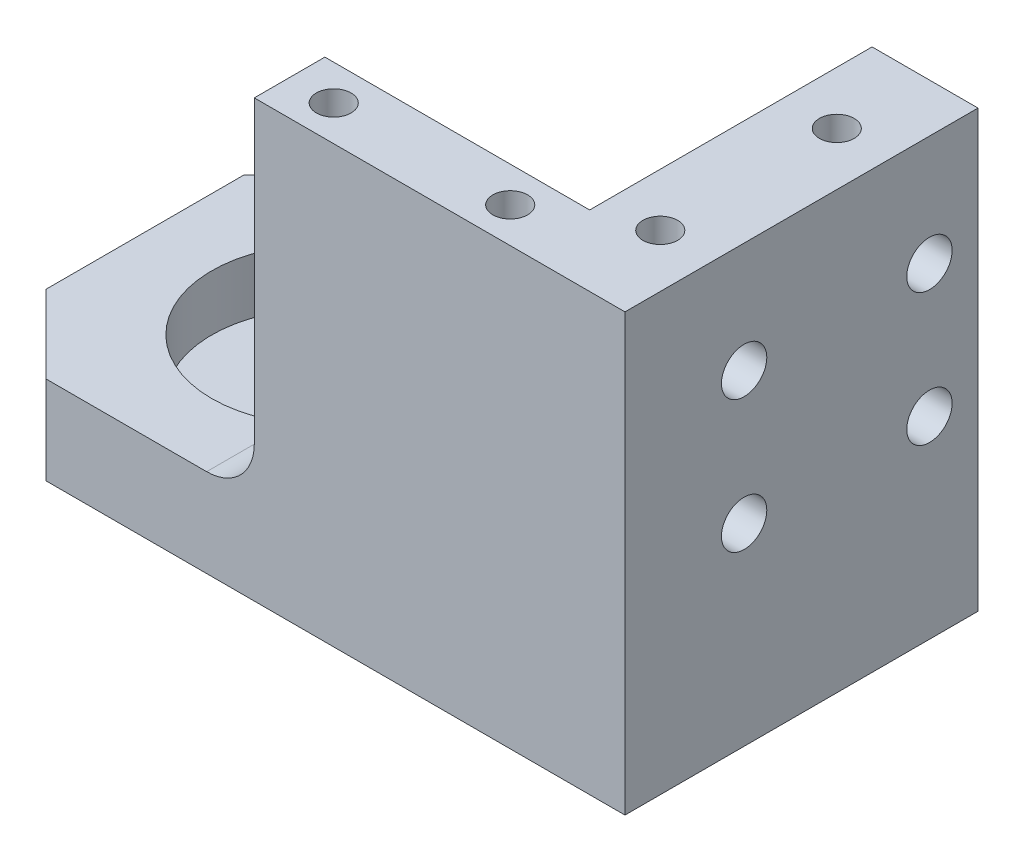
ISO-10303-21;
HEADER;
FILE_DESCRIPTION(('STEP AP214'),'2;1');
FILE_NAME('part.step','',(''),(''),'','','');
FILE_SCHEMA(('AUTOMOTIVE_DESIGN { 1 0 10303 214 1 1 1 1 }'));
ENDSEC;
DATA;
#1=APPLICATION_CONTEXT('core data for automotive mechanical design processes');
#2=APPLICATION_PROTOCOL_DEFINITION('international standard','automotive_design',2000,#1);
#3=PRODUCT_CONTEXT('',#1,'mechanical');
#4=PRODUCT('Part','Part','',(#3));
#5=PRODUCT_RELATED_PRODUCT_CATEGORY('part','',(#4));
#6=PRODUCT_DEFINITION_FORMATION('','',#4);
#7=PRODUCT_DEFINITION_CONTEXT('part definition',#1,'design');
#8=PRODUCT_DEFINITION('design','',#6,#7);
#9=PRODUCT_DEFINITION_SHAPE('','',#8);
#10=(LENGTH_UNIT() NAMED_UNIT(*) SI_UNIT(.MILLI.,.METRE.));
#11=(NAMED_UNIT(*) PLANE_ANGLE_UNIT() SI_UNIT($,.RADIAN.));
#12=(NAMED_UNIT(*) SI_UNIT($,.STERADIAN.) SOLID_ANGLE_UNIT());
#13=UNCERTAINTY_MEASURE_WITH_UNIT(LENGTH_MEASURE(1.E-05),#10,'distance_accuracy_value','');
#14=(GEOMETRIC_REPRESENTATION_CONTEXT(3) GLOBAL_UNCERTAINTY_ASSIGNED_CONTEXT((#13)) GLOBAL_UNIT_ASSIGNED_CONTEXT((#10,
#11,#12)) REPRESENTATION_CONTEXT('',''));
#15=CARTESIAN_POINT('',(0.,0.,0.));
#16=DIRECTION('',(0.,0.,1.));
#17=DIRECTION('',(1.,0.,0.));
#18=AXIS2_PLACEMENT_3D('',#15,#16,#17);
#19=CARTESIAN_POINT('',(-1.27,-36.0425,8.9916));
#20=DIRECTION('',(0.,1.,0.));
#21=DIRECTION('',(0.,0.,1.));
#22=AXIS2_PLACEMENT_3D('',#19,#20,#21);
#23=PLANE('',#22);
#24=DIRECTION('',(-1.,0.,0.));
#25=VECTOR('',#24,1.);
#26=CARTESIAN_POINT('',(-7.61999999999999,-36.0425,-10.16));
#27=LINE('',#26,#25);
#28=CARTESIAN_POINT('',(-7.61999999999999,-36.0425,-10.16));
#29=VERTEX_POINT('',#28);
#30=CARTESIAN_POINT('',(-18.796,-36.0425,-10.16));
#31=VERTEX_POINT('',#30);
#32=EDGE_CURVE('E273',#29,#31,#27,.T.);
#33=ORIENTED_EDGE('',*,*,#32,.F.);
#34=DIRECTION('',(0.,0.,1.));
#35=VECTOR('',#34,1.);
#36=CARTESIAN_POINT('',(-7.61999999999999,-36.0425,-12.7));
#37=LINE('',#36,#35);
#38=CARTESIAN_POINT('',(-7.61999999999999,-36.0425,-12.7));
#39=VERTEX_POINT('',#38);
#40=EDGE_CURVE('E270',#39,#29,#37,.T.);
#41=ORIENTED_EDGE('',*,*,#40,.F.);
#42=DIRECTION('',(1.,0.,0.));
#43=VECTOR('',#42,1.);
#44=CARTESIAN_POINT('',(-1.27,-36.0425,-12.7));
#45=LINE('',#44,#43);
#46=CARTESIAN_POINT('',(0.,-36.0425,-12.7));
#47=VERTEX_POINT('',#46);
#48=EDGE_CURVE('E316',#39,#47,#45,.T.);
#49=ORIENTED_EDGE('',*,*,#48,.T.);
#50=DIRECTION('',(0.,0.,1.));
#51=VECTOR('',#50,1.);
#52=CARTESIAN_POINT('',(0.,-36.0425,8.9916));
#53=LINE('',#52,#51);
#54=CARTESIAN_POINT('',(0.,-36.0425,12.7));
#55=VERTEX_POINT('',#54);
#56=EDGE_CURVE('E321',#47,#55,#53,.T.);
#57=ORIENTED_EDGE('',*,*,#56,.T.);
#58=DIRECTION('',(-1.,0.,0.));
#59=VECTOR('',#58,1.);
#60=CARTESIAN_POINT('',(-1.27,-36.0425,12.7));
#61=LINE('',#60,#59);
#62=CARTESIAN_POINT('',(-41.656,-36.0425,12.7));
#63=VERTEX_POINT('',#62);
#64=EDGE_CURVE('E307',#55,#63,#61,.T.);
#65=ORIENTED_EDGE('',*,*,#64,.T.);
#66=DIRECTION('',(0.707106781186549,0.,0.707106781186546));
#67=VECTOR('',#66,1.);
#68=CARTESIAN_POINT('',(-47.244,-36.0425,7.11199999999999));
#69=LINE('',#68,#67);
#70=CARTESIAN_POINT('',(-47.244,-36.0425,7.11199999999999));
#71=VERTEX_POINT('',#70);
#72=EDGE_CURVE('E477',#63,#71,#69,.F.);
#73=ORIENTED_EDGE('',*,*,#72,.T.);
#74=DIRECTION('',(0.,0.,-1.));
#75=VECTOR('',#74,1.);
#76=CARTESIAN_POINT('',(-47.244,-36.0425,12.7));
#77=LINE('',#76,#75);
#78=CARTESIAN_POINT('',(-47.244,-36.0425,-7.11199999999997));
#79=VERTEX_POINT('',#78);
#80=EDGE_CURVE('E311',#71,#79,#77,.T.);
#81=ORIENTED_EDGE('',*,*,#80,.T.);
#82=DIRECTION('',(-0.707106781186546,0.,0.707106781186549));
#83=VECTOR('',#82,1.);
#84=CARTESIAN_POINT('',(-41.656,-36.0425,-12.7));
#85=LINE('',#84,#83);
#86=CARTESIAN_POINT('',(-41.656,-36.0425,-12.7));
#87=VERTEX_POINT('',#86);
#88=EDGE_CURVE('E472',#79,#87,#85,.F.);
#89=ORIENTED_EDGE('',*,*,#88,.T.);
#90=CARTESIAN_POINT('',(-18.796,-36.0425,-12.7));
#91=VERTEX_POINT('',#90);
#92=EDGE_CURVE('E317',#87,#91,#45,.T.);
#93=ORIENTED_EDGE('',*,*,#92,.T.);
#94=DIRECTION('',(0.,0.,-1.));
#95=VECTOR('',#94,1.);
#96=CARTESIAN_POINT('',(-18.796,-36.0425,-12.7));
#97=LINE('',#96,#95);
#98=EDGE_CURVE('E277',#31,#91,#97,.T.);
#99=ORIENTED_EDGE('',*,*,#98,.F.);
#100=EDGE_LOOP('',(#33,#41,#49,#57,#65,#73,#81,#89,#93,#99));
#101=FACE_BOUND('',#100,.T.);
#102=CARTESIAN_POINT('',(-34.47288,-36.0425,0.));
#103=DIRECTION('',(0.,1.,0.));
#104=DIRECTION('',(0.,0.,1.));
#105=AXIS2_PLACEMENT_3D('',#102,#103,#104);
#106=CIRCLE('',#105,7.9375);
#107=CARTESIAN_POINT('',(-34.47288,-36.0425,7.9375));
#108=VERTEX_POINT('',#107);
#109=EDGE_CURVE('E12',#108,#108,#106,.F.);
#110=ORIENTED_EDGE('',*,*,#109,.F.);
#111=EDGE_LOOP('',(#110));
#112=FACE_BOUND('',#111,.T.);
#113=ADVANCED_FACE('F47',(#101,#112),#23,.F.);
#114=CARTESIAN_POINT('',(-34.47288,0.001000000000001,0.));
#115=DIRECTION('',(0.,-1.,0.));
#116=DIRECTION('',(0.,0.,-1.));
#117=AXIS2_PLACEMENT_3D('',#114,#115,#116);
#118=CYLINDRICAL_SURFACE('',#117,3.33375);
#119=CARTESIAN_POINT('',(-34.47288,-36.0425,0.));
#120=DIRECTION('',(0.,-1.,0.));
#121=DIRECTION('',(0.,0.,-1.));
#122=AXIS2_PLACEMENT_3D('',#119,#120,#121);
#123=CIRCLE('',#122,3.33375);
#124=CARTESIAN_POINT('',(-34.47288,-36.0425,-3.33375));
#125=VERTEX_POINT('',#124);
#126=EDGE_CURVE('E302',#125,#125,#123,.T.);
#127=ORIENTED_EDGE('',*,*,#126,.T.);
#128=EDGE_LOOP('',(#127));
#129=FACE_BOUND('',#128,.T.);
#130=CARTESIAN_POINT('',(-34.47288,-33.6925,0.));
#131=DIRECTION('',(0.,1.,0.));
#132=DIRECTION('',(0.,0.,1.));
#133=AXIS2_PLACEMENT_3D('',#130,#131,#132);
#134=CIRCLE('',#133,3.33375);
#135=CARTESIAN_POINT('',(-34.47288,-33.6925,3.33375));
#136=VERTEX_POINT('',#135);
#137=EDGE_CURVE('E228',#136,#136,#134,.F.);
#138=ORIENTED_EDGE('',*,*,#137,.F.);
#139=EDGE_LOOP('',(#138));
#140=FACE_BOUND('',#139,.T.);
#141=ADVANCED_FACE('F402',(#129,#140),#118,.F.);
#142=CARTESIAN_POINT('',(-47.244,0.,-12.7));
#143=DIRECTION('',(0.,0.,1.));
#144=DIRECTION('',(-1.,0.,0.));
#145=AXIS2_PLACEMENT_3D('',#142,#143,#144);
#146=PLANE('',#145);
#147=CARTESIAN_POINT('',(-4.14019999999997,-32.8675,-12.7));
#148=DIRECTION('',(0.,0.,-1.));
#149=DIRECTION('',(-1.,0.,0.));
#150=AXIS2_PLACEMENT_3D('',#147,#148,#149);
#151=CIRCLE('',#150,1.28905);
#152=CARTESIAN_POINT('',(-5.42924999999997,-32.8675,-12.7));
#153=VERTEX_POINT('',#152);
#154=EDGE_CURVE('E266',#153,#153,#151,.T.);
#155=ORIENTED_EDGE('',*,*,#154,.F.);
#156=EDGE_LOOP('',(#155));
#157=FACE_BOUND('',#156,.T.);
#158=DIRECTION('',(0.,-1.,0.));
#159=VECTOR('',#158,1.);
#160=CARTESIAN_POINT('',(-7.62,-5.07999999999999,-12.7));
#161=LINE('',#160,#159);
#162=CARTESIAN_POINT('',(-7.62,-4.686249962,-12.7));
#163=VERTEX_POINT('',#162);
#164=EDGE_CURVE('E343',#163,#39,#161,.T.);
#165=ORIENTED_EDGE('',*,*,#164,.F.);
#166=DIRECTION('',(-1.,0.,0.));
#167=VECTOR('',#166,1.);
#168=CARTESIAN_POINT('',(0.,-4.686249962,-12.7));
#169=LINE('',#168,#167);
#170=CARTESIAN_POINT('',(0.,-4.686249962,-12.7));
#171=VERTEX_POINT('',#170);
#172=EDGE_CURVE('E202',#171,#163,#169,.T.);
#173=ORIENTED_EDGE('',*,*,#172,.F.);
#174=DIRECTION('',(0.,-1.,0.));
#175=VECTOR('',#174,1.);
#176=CARTESIAN_POINT('',(0.,-36.0425,-12.7));
#177=LINE('',#176,#175);
#178=EDGE_CURVE('E299',#171,#47,#177,.T.);
#179=ORIENTED_EDGE('',*,*,#178,.T.);
#180=ORIENTED_EDGE('',*,*,#48,.F.);
#181=EDGE_LOOP('',(#165,#173,#179,#180));
#182=FACE_BOUND('',#181,.T.);
#183=ADVANCED_FACE('F404',(#157,#182),#146,.F.);
#184=CARTESIAN_POINT('',(-23.1902,-32.8675,-12.7));
#185=DIRECTION('',(0.,0.,-1.));
#186=DIRECTION('',(-1.,0.,0.));
#187=AXIS2_PLACEMENT_3D('',#184,#185,#186);
#188=CIRCLE('',#187,1.28905);
#189=CARTESIAN_POINT('',(-24.47925,-32.8675,-12.7));
#190=VERTEX_POINT('',#189);
#191=EDGE_CURVE('E258',#190,#190,#188,.T.);
#192=ORIENTED_EDGE('',*,*,#191,.F.);
#193=EDGE_LOOP('',(#192));
#194=FACE_BOUND('',#193,.T.);
#195=DIRECTION('',(1.,0.,0.));
#196=VECTOR('',#195,1.);
#197=CARTESIAN_POINT('',(-1.27,-29.6925,-12.7));
#198=LINE('',#197,#196);
#199=CARTESIAN_POINT('',(-41.656,-29.6925,-12.7));
#200=VERTEX_POINT('',#199);
#201=CARTESIAN_POINT('',(-18.796,-29.6925,-12.7));
#202=VERTEX_POINT('',#201);
#203=EDGE_CURVE('E312',#200,#202,#198,.T.);
#204=ORIENTED_EDGE('',*,*,#203,.T.);
#205=DIRECTION('',(0.,-1.,0.));
#206=VECTOR('',#205,1.);
#207=CARTESIAN_POINT('',(-18.796,-23.3425,-12.7));
#208=LINE('',#207,#206);
#209=EDGE_CURVE('E280',#202,#91,#208,.T.);
#210=ORIENTED_EDGE('',*,*,#209,.T.);
#211=ORIENTED_EDGE('',*,*,#92,.F.);
#212=DIRECTION('',(0.,1.,0.));
#213=VECTOR('',#212,1.);
#214=CARTESIAN_POINT('',(-41.656,0.,-12.7));
#215=LINE('',#214,#213);
#216=EDGE_CURVE('E347',#87,#200,#215,.T.);
#217=ORIENTED_EDGE('',*,*,#216,.T.);
#218=EDGE_LOOP('',(#204,#210,#211,#217));
#219=FACE_BOUND('',#218,.T.);
#220=ADVANCED_FACE('F411',(#194,#219),#146,.F.);
#221=CARTESIAN_POINT('',(-7.62,-5.07999999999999,12.7));
#222=DIRECTION('',(1.,0.,0.));
#223=DIRECTION('',(0.,1.,0.));
#224=AXIS2_PLACEMENT_3D('',#221,#222,#223);
#225=PLANE('',#224);
#226=CARTESIAN_POINT('',(-7.62,-12.62375,4.1275));
#227=DIRECTION('',(1.,0.,0.));
#228=DIRECTION('',(0.,1.,0.));
#229=AXIS2_PLACEMENT_3D('',#226,#227,#228);
#230=CIRCLE('',#229,1.63194999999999);
#231=CARTESIAN_POINT('',(-7.62,-10.9918,4.1275));
#232=VERTEX_POINT('',#231);
#233=EDGE_CURVE('E236',#232,#232,#230,.T.);
#234=ORIENTED_EDGE('',*,*,#233,.T.);
#235=EDGE_LOOP('',(#234));
#236=FACE_BOUND('',#235,.T.);
#237=CARTESIAN_POINT('',(-7.62,-12.62375,-9.2075));
#238=DIRECTION('',(1.,0.,0.));
#239=DIRECTION('',(0.,1.,0.));
#240=AXIS2_PLACEMENT_3D('',#237,#238,#239);
#241=CIRCLE('',#240,1.63194999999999);
#242=CARTESIAN_POINT('',(-7.62,-10.9918,-9.2075));
#243=VERTEX_POINT('',#242);
#244=EDGE_CURVE('E243',#243,#243,#241,.T.);
#245=ORIENTED_EDGE('',*,*,#244,.T.);
#246=EDGE_LOOP('',(#245));
#247=FACE_BOUND('',#246,.T.);
#248=CARTESIAN_POINT('',(-7.62,-22.14875,4.1275));
#249=DIRECTION('',(1.,0.,0.));
#250=DIRECTION('',(0.,1.,0.));
#251=AXIS2_PLACEMENT_3D('',#248,#249,#250);
#252=CIRCLE('',#251,1.63194999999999);
#253=CARTESIAN_POINT('',(-7.62,-20.5168,4.1275));
#254=VERTEX_POINT('',#253);
#255=EDGE_CURVE('E248',#254,#254,#252,.T.);
#256=ORIENTED_EDGE('',*,*,#255,.T.);
#257=EDGE_LOOP('',(#256));
#258=FACE_BOUND('',#257,.T.);
#259=CARTESIAN_POINT('',(-7.62,-22.14875,-9.2075));
#260=DIRECTION('',(1.,0.,0.));
#261=DIRECTION('',(0.,1.,0.));
#262=AXIS2_PLACEMENT_3D('',#259,#260,#261);
#263=CIRCLE('',#262,1.63194999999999);
#264=CARTESIAN_POINT('',(-7.62,-20.5168,-9.2075));
#265=VERTEX_POINT('',#264);
#266=EDGE_CURVE('E253',#265,#265,#263,.T.);
#267=ORIENTED_EDGE('',*,*,#266,.T.);
#268=EDGE_LOOP('',(#267));
#269=FACE_BOUND('',#268,.T.);
#270=DIRECTION('',(0.,-1.,0.));
#271=VECTOR('',#270,1.);
#272=CARTESIAN_POINT('',(-7.61999999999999,-23.3425,-10.16));
#273=LINE('',#272,#271);
#274=CARTESIAN_POINT('',(-7.62,-26.2635,-10.16));
#275=VERTEX_POINT('',#274);
#276=EDGE_CURVE('E66',#275,#29,#273,.T.);
#277=ORIENTED_EDGE('',*,*,#276,.F.);
#278=DIRECTION('',(0.,0.,-1.));
#279=VECTOR('',#278,1.);
#280=CARTESIAN_POINT('',(-7.62,-26.2635,12.7));
#281=LINE('',#280,#279);
#282=CARTESIAN_POINT('',(-7.62,-26.2635,7.62));
#283=VERTEX_POINT('',#282);
#284=EDGE_CURVE('E74',#275,#283,#281,.F.);
#285=ORIENTED_EDGE('',*,*,#284,.T.);
#286=DIRECTION('',(0.,1.,0.));
#287=VECTOR('',#286,1.);
#288=CARTESIAN_POINT('',(-7.62,-5.07999999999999,7.62));
#289=LINE('',#288,#287);
#290=CARTESIAN_POINT('',(-7.62,-4.686249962,7.62));
#291=VERTEX_POINT('',#290);
#292=EDGE_CURVE('E177',#283,#291,#289,.T.);
#293=ORIENTED_EDGE('',*,*,#292,.T.);
#294=DIRECTION('',(0.,0.,1.));
#295=VECTOR('',#294,1.);
#296=CARTESIAN_POINT('',(-7.62,-4.686249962,-12.7));
#297=LINE('',#296,#295);
#298=EDGE_CURVE('E181',#163,#291,#297,.T.);
#299=ORIENTED_EDGE('',*,*,#298,.F.);
#300=ORIENTED_EDGE('',*,*,#164,.T.);
#301=ORIENTED_EDGE('',*,*,#40,.T.);
#302=EDGE_LOOP('',(#277,#285,#293,#299,#300,#301));
#303=FACE_BOUND('',#302,.T.);
#304=ADVANCED_FACE('F179',(#236,#247,#258,#269,#303),#225,.F.);
#305=CARTESIAN_POINT('',(0.,0.,12.7));
#306=DIRECTION('',(-1.,0.,0.));
#307=DIRECTION('',(0.,-1.,0.));
#308=AXIS2_PLACEMENT_3D('',#305,#306,#307);
#309=PLANE('',#308);
#310=CARTESIAN_POINT('',(0.,-12.62375,4.1275));
#311=DIRECTION('',(1.,0.,0.));
#312=DIRECTION('',(0.,0.,-1.));
#313=AXIS2_PLACEMENT_3D('',#310,#311,#312);
#314=CIRCLE('',#313,1.63194999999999);
#315=CARTESIAN_POINT('',(0.,-12.62375,2.49555000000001));
#316=VERTEX_POINT('',#315);
#317=EDGE_CURVE('E232',#316,#316,#314,.T.);
#318=ORIENTED_EDGE('',*,*,#317,.F.);
#319=EDGE_LOOP('',(#318));
#320=FACE_BOUND('',#319,.T.);
#321=CARTESIAN_POINT('',(0.,-12.62375,-9.2075));
#322=DIRECTION('',(1.,0.,0.));
#323=DIRECTION('',(0.,0.,-1.));
#324=AXIS2_PLACEMENT_3D('',#321,#322,#323);
#325=CIRCLE('',#324,1.63194999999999);
#326=CARTESIAN_POINT('',(0.,-12.62375,-10.83945));
#327=VERTEX_POINT('',#326);
#328=EDGE_CURVE('E239',#327,#327,#325,.T.);
#329=ORIENTED_EDGE('',*,*,#328,.F.);
#330=EDGE_LOOP('',(#329));
#331=FACE_BOUND('',#330,.T.);
#332=CARTESIAN_POINT('',(0.,-22.14875,4.1275));
#333=DIRECTION('',(1.,0.,0.));
#334=DIRECTION('',(0.,0.,-1.));
#335=AXIS2_PLACEMENT_3D('',#332,#333,#334);
#336=CIRCLE('',#335,1.63194999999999);
#337=CARTESIAN_POINT('',(0.,-22.14875,2.49555000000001));
#338=VERTEX_POINT('',#337);
#339=EDGE_CURVE('E244',#338,#338,#336,.T.);
#340=ORIENTED_EDGE('',*,*,#339,.F.);
#341=EDGE_LOOP('',(#340));
#342=FACE_BOUND('',#341,.T.);
#343=CARTESIAN_POINT('',(0.,-22.14875,-9.2075));
#344=DIRECTION('',(1.,0.,0.));
#345=DIRECTION('',(0.,0.,-1.));
#346=AXIS2_PLACEMENT_3D('',#343,#344,#345);
#347=CIRCLE('',#346,1.63194999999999);
#348=CARTESIAN_POINT('',(0.,-22.14875,-10.83945));
#349=VERTEX_POINT('',#348);
#350=EDGE_CURVE('E249',#349,#349,#347,.T.);
#351=ORIENTED_EDGE('',*,*,#350,.F.);
#352=EDGE_LOOP('',(#351));
#353=FACE_BOUND('',#352,.T.);
#354=ORIENTED_EDGE('',*,*,#178,.F.);
#355=DIRECTION('',(0.,0.,-1.));
#356=VECTOR('',#355,1.);
#357=CARTESIAN_POINT('',(0.,-4.686249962,12.7));
#358=LINE('',#357,#356);
#359=CARTESIAN_POINT('',(0.,-4.686249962,12.7));
#360=VERTEX_POINT('',#359);
#361=EDGE_CURVE('E219',#360,#171,#358,.T.);
#362=ORIENTED_EDGE('',*,*,#361,.F.);
#363=DIRECTION('',(0.,-1.,0.));
#364=VECTOR('',#363,1.);
#365=CARTESIAN_POINT('',(0.,-36.0425,12.7));
#366=LINE('',#365,#364);
#367=EDGE_CURVE('E296',#360,#55,#366,.T.);
#368=ORIENTED_EDGE('',*,*,#367,.T.);
#369=ORIENTED_EDGE('',*,*,#56,.F.);
#370=EDGE_LOOP('',(#354,#362,#368,#369));
#371=FACE_BOUND('',#370,.T.);
#372=ADVANCED_FACE('F441',(#320,#331,#342,#353,#371),#309,.F.);
#373=CARTESIAN_POINT('',(-47.244,0.,12.7));
#374=DIRECTION('',(0.,0.,-1.));
#375=DIRECTION('',(-1.,0.,0.));
#376=AXIS2_PLACEMENT_3D('',#373,#374,#375);
#377=PLANE('',#376);
#378=ORIENTED_EDGE('',*,*,#367,.F.);
#379=DIRECTION('',(1.,0.,0.));
#380=VECTOR('',#379,1.);
#381=CARTESIAN_POINT('',(-26.67,-4.686249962,12.7));
#382=LINE('',#381,#380);
#383=CARTESIAN_POINT('',(-26.67,-4.686249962,12.7));
#384=VERTEX_POINT('',#383);
#385=EDGE_CURVE('E215',#384,#360,#382,.T.);
#386=ORIENTED_EDGE('',*,*,#385,.F.);
#387=DIRECTION('',(0.,-1.,0.));
#388=VECTOR('',#387,1.);
#389=CARTESIAN_POINT('',(-26.67,-5.08,12.7));
#390=LINE('',#389,#388);
#391=CARTESIAN_POINT('',(-26.67,-26.2635,12.7));
#392=VERTEX_POINT('',#391);
#393=EDGE_CURVE('E186',#384,#392,#390,.T.);
#394=ORIENTED_EDGE('',*,*,#393,.T.);
#395=CARTESIAN_POINT('',(-30.099,-26.2635,12.7));
#396=DIRECTION('',(0.,0.,-1.));
#397=DIRECTION('',(-1.,0.,0.));
#398=AXIS2_PLACEMENT_3D('',#395,#396,#397);
#399=CIRCLE('',#398,3.429);
#400=CARTESIAN_POINT('',(-30.099,-29.6925,12.7));
#401=VERTEX_POINT('',#400);
#402=EDGE_CURVE('E385',#392,#401,#399,.T.);
#403=ORIENTED_EDGE('',*,*,#402,.T.);
#404=DIRECTION('',(-1.,0.,0.));
#405=VECTOR('',#404,1.);
#406=CARTESIAN_POINT('',(-1.27,-29.6925,12.7));
#407=LINE('',#406,#405);
#408=CARTESIAN_POINT('',(-41.656,-29.6925,12.7));
#409=VERTEX_POINT('',#408);
#410=EDGE_CURVE('E306',#401,#409,#407,.T.);
#411=ORIENTED_EDGE('',*,*,#410,.T.);
#412=DIRECTION('',(0.,-1.,0.));
#413=VECTOR('',#412,1.);
#414=CARTESIAN_POINT('',(-41.656,0.,12.7));
#415=LINE('',#414,#413);
#416=EDGE_CURVE('E469',#409,#63,#415,.T.);
#417=ORIENTED_EDGE('',*,*,#416,.T.);
#418=ORIENTED_EDGE('',*,*,#64,.F.);
#419=EDGE_LOOP('',(#378,#386,#394,#403,#411,#417,#418));
#420=FACE_BOUND('',#419,.T.);
#421=ADVANCED_FACE('F435',(#420),#377,.F.);
#422=CARTESIAN_POINT('',(-26.67,-5.08,7.62));
#423=DIRECTION('',(-1.,0.,0.));
#424=DIRECTION('',(0.,-1.,0.));
#425=AXIS2_PLACEMENT_3D('',#422,#423,#424);
#426=PLANE('',#425);
#427=DIRECTION('',(0.,-1.,0.));
#428=VECTOR('',#427,1.);
#429=CARTESIAN_POINT('',(-26.67,-5.08,7.62));
#430=LINE('',#429,#428);
#431=CARTESIAN_POINT('',(-26.67,-4.686249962,7.62));
#432=VERTEX_POINT('',#431);
#433=CARTESIAN_POINT('',(-26.67,-26.2635,7.62));
#434=VERTEX_POINT('',#433);
#435=EDGE_CURVE('E185',#432,#434,#430,.T.);
#436=ORIENTED_EDGE('',*,*,#435,.T.);
#437=DIRECTION('',(0.,0.,1.));
#438=VECTOR('',#437,1.);
#439=CARTESIAN_POINT('',(-26.67,-26.2635,12.7));
#440=LINE('',#439,#438);
#441=EDGE_CURVE('E333',#434,#392,#440,.T.);
#442=ORIENTED_EDGE('',*,*,#441,.T.);
#443=ORIENTED_EDGE('',*,*,#393,.F.);
#444=DIRECTION('',(0.,0.,1.));
#445=VECTOR('',#444,1.);
#446=CARTESIAN_POINT('',(-26.67,-4.686249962,7.62));
#447=LINE('',#446,#445);
#448=EDGE_CURVE('E196',#432,#384,#447,.T.);
#449=ORIENTED_EDGE('',*,*,#448,.F.);
#450=EDGE_LOOP('',(#436,#442,#443,#449));
#451=FACE_BOUND('',#450,.T.);
#452=ADVANCED_FACE('F433',(#451),#426,.T.);
#453=CARTESIAN_POINT('',(-7.62,-5.07999999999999,7.62));
#454=DIRECTION('',(0.,0.,-1.));
#455=DIRECTION('',(-1.,0.,0.));
#456=AXIS2_PLACEMENT_3D('',#453,#454,#455);
#457=PLANE('',#456);
#458=ORIENTED_EDGE('',*,*,#292,.F.);
#459=CARTESIAN_POINT('',(-11.049,-26.2635,7.62));
#460=DIRECTION('',(0.,0.,-1.));
#461=DIRECTION('',(-1.,0.,0.));
#462=AXIS2_PLACEMENT_3D('',#459,#460,#461);
#463=CIRCLE('',#462,3.429);
#464=CARTESIAN_POINT('',(-11.049,-29.6925,7.62));
#465=VERTEX_POINT('',#464);
#466=EDGE_CURVE('E379',#283,#465,#463,.T.);
#467=ORIENTED_EDGE('',*,*,#466,.T.);
#468=DIRECTION('',(1.,0.,0.));
#469=VECTOR('',#468,1.);
#470=CARTESIAN_POINT('',(-7.61999999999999,-29.6925,7.62));
#471=LINE('',#470,#469);
#472=CARTESIAN_POINT('',(-30.099,-29.6925,7.62));
#473=VERTEX_POINT('',#472);
#474=EDGE_CURVE('E348',#473,#465,#471,.T.);
#475=ORIENTED_EDGE('',*,*,#474,.F.);
#476=CARTESIAN_POINT('',(-30.099,-26.2635,7.62));
#477=DIRECTION('',(0.,0.,-1.));
#478=DIRECTION('',(-1.,0.,0.));
#479=AXIS2_PLACEMENT_3D('',#476,#477,#478);
#480=CIRCLE('',#479,3.429);
#481=EDGE_CURVE('E382',#473,#434,#480,.F.);
#482=ORIENTED_EDGE('',*,*,#481,.T.);
#483=ORIENTED_EDGE('',*,*,#435,.F.);
#484=DIRECTION('',(-1.,0.,0.));
#485=VECTOR('',#484,1.);
#486=CARTESIAN_POINT('',(-7.62,-4.686249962,7.62));
#487=LINE('',#486,#485);
#488=EDGE_CURVE('E189',#291,#432,#487,.T.);
#489=ORIENTED_EDGE('',*,*,#488,.F.);
#490=EDGE_LOOP('',(#458,#467,#475,#482,#483,#489));
#491=FACE_BOUND('',#490,.T.);
#492=ADVANCED_FACE('F190',(#491),#457,.T.);
#493=CARTESIAN_POINT('',(-1.27,-29.6925,8.9916));
#494=DIRECTION('',(0.,1.,0.));
#495=DIRECTION('',(0.,0.,1.));
#496=AXIS2_PLACEMENT_3D('',#493,#494,#495);
#497=PLANE('',#496);
#498=CARTESIAN_POINT('',(-34.47288,-29.6925,0.));
#499=DIRECTION('',(0.,1.,0.));
#500=DIRECTION('',(0.,0.,1.));
#501=AXIS2_PLACEMENT_3D('',#498,#499,#500);
#502=CIRCLE('',#501,7.9629);
#503=CARTESIAN_POINT('',(-34.47288,-29.6925,7.9629));
#504=VERTEX_POINT('',#503);
#505=EDGE_CURVE('E223',#504,#504,#502,.T.);
#506=ORIENTED_EDGE('',*,*,#505,.F.);
#507=EDGE_LOOP('',(#506));
#508=FACE_BOUND('',#507,.T.);
#509=ORIENTED_EDGE('',*,*,#410,.F.);
#510=DIRECTION('',(0.,0.,1.));
#511=VECTOR('',#510,1.);
#512=CARTESIAN_POINT('',(-30.099,-29.6925,7.62));
#513=LINE('',#512,#511);
#514=EDGE_CURVE('E339',#401,#473,#513,.F.);
#515=ORIENTED_EDGE('',*,*,#514,.T.);
#516=ORIENTED_EDGE('',*,*,#474,.T.);
#517=DIRECTION('',(0.,0.,-1.));
#518=VECTOR('',#517,1.);
#519=CARTESIAN_POINT('',(-11.049,-29.6925,8.9916));
#520=LINE('',#519,#518);
#521=CARTESIAN_POINT('',(-11.049,-29.6925,-10.16));
#522=VERTEX_POINT('',#521);
#523=EDGE_CURVE('E335',#465,#522,#520,.T.);
#524=ORIENTED_EDGE('',*,*,#523,.T.);
#525=DIRECTION('',(1.,0.,0.));
#526=VECTOR('',#525,1.);
#527=CARTESIAN_POINT('',(-1.27,-29.6925,-10.16));
#528=LINE('',#527,#526);
#529=CARTESIAN_POINT('',(-18.796,-29.6925,-10.16));
#530=VERTEX_POINT('',#529);
#531=EDGE_CURVE('E284',#530,#522,#528,.T.);
#532=ORIENTED_EDGE('',*,*,#531,.F.);
#533=DIRECTION('',(0.,0.,1.));
#534=VECTOR('',#533,1.);
#535=CARTESIAN_POINT('',(-18.796,-29.6925,8.99159999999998));
#536=LINE('',#535,#534);
#537=EDGE_CURVE('E293',#202,#530,#536,.T.);
#538=ORIENTED_EDGE('',*,*,#537,.F.);
#539=ORIENTED_EDGE('',*,*,#203,.F.);
#540=DIRECTION('',(0.707106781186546,0.,-0.707106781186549));
#541=VECTOR('',#540,1.);
#542=CARTESIAN_POINT('',(-32.3088000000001,-29.6925,-22.0472));
#543=LINE('',#542,#541);
#544=CARTESIAN_POINT('',(-47.244,-29.6925,-7.11199999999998));
#545=VERTEX_POINT('',#544);
#546=EDGE_CURVE('E489',#200,#545,#543,.F.);
#547=ORIENTED_EDGE('',*,*,#546,.T.);
#548=DIRECTION('',(0.,0.,-1.));
#549=VECTOR('',#548,1.);
#550=CARTESIAN_POINT('',(-47.244,-29.6925,12.7));
#551=LINE('',#550,#549);
#552=CARTESIAN_POINT('',(-47.244,-29.6925,7.11199999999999));
#553=VERTEX_POINT('',#552);
#554=EDGE_CURVE('E327',#553,#545,#551,.T.);
#555=ORIENTED_EDGE('',*,*,#554,.F.);
#556=DIRECTION('',(-0.707106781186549,0.,-0.707106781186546));
#557=VECTOR('',#556,1.);
#558=CARTESIAN_POINT('',(-23.3171999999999,-29.6925,31.0388));
#559=LINE('',#558,#557);
#560=EDGE_CURVE('E491',#553,#409,#559,.F.);
#561=ORIENTED_EDGE('',*,*,#560,.T.);
#562=EDGE_LOOP('',(#509,#515,#516,#524,#532,#538,#539,#547,#555,#561));
#563=FACE_BOUND('',#562,.T.);
#564=ADVANCED_FACE('F374',(#508,#563),#497,.T.);
#565=CARTESIAN_POINT('',(-47.244,-36.0425,12.7));
#566=DIRECTION('',(1.,0.,0.));
#567=DIRECTION('',(0.,0.,-1.));
#568=AXIS2_PLACEMENT_3D('',#565,#566,#567);
#569=PLANE('',#568);
#570=ORIENTED_EDGE('',*,*,#554,.T.);
#571=DIRECTION('',(0.,-1.,0.));
#572=VECTOR('',#571,1.);
#573=CARTESIAN_POINT('',(-47.244,-36.0425,-7.11199999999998));
#574=LINE('',#573,#572);
#575=EDGE_CURVE('E482',#545,#79,#574,.T.);
#576=ORIENTED_EDGE('',*,*,#575,.T.);
#577=ORIENTED_EDGE('',*,*,#80,.F.);
#578=DIRECTION('',(0.,1.,0.));
#579=VECTOR('',#578,1.);
#580=CARTESIAN_POINT('',(-47.244,-36.0425,7.11199999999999));
#581=LINE('',#580,#579);
#582=EDGE_CURVE('E485',#71,#553,#581,.T.);
#583=ORIENTED_EDGE('',*,*,#582,.T.);
#584=EDGE_LOOP('',(#570,#576,#577,#583));
#585=FACE_BOUND('',#584,.T.);
#586=ADVANCED_FACE('F423',(#585),#569,.F.);
#587=ORIENTED_EDGE('',*,*,#109,.T.);
#588=EDGE_LOOP('',(#587));
#589=FACE_BOUND('',#588,.T.);
#590=ORIENTED_EDGE('',*,*,#126,.F.);
#591=EDGE_LOOP('',(#590));
#592=FACE_BOUND('',#591,.T.);
#593=ADVANCED_FACE('F416',(#589,#592),#23,.F.);
#594=CARTESIAN_POINT('',(-41.656,0.,-12.7));
#595=DIRECTION('',(0.707106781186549,0.,0.707106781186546));
#596=DIRECTION('',(0.707106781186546,0.,-0.707106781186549));
#597=AXIS2_PLACEMENT_3D('',#594,#595,#596);
#598=PLANE('',#597);
#599=ORIENTED_EDGE('',*,*,#88,.F.);
#600=ORIENTED_EDGE('',*,*,#575,.F.);
#601=ORIENTED_EDGE('',*,*,#546,.F.);
#602=ORIENTED_EDGE('',*,*,#216,.F.);
#603=EDGE_LOOP('',(#599,#600,#601,#602));
#604=FACE_BOUND('',#603,.T.);
#605=ADVANCED_FACE('F422',(#604),#598,.F.);
#606=CARTESIAN_POINT('',(-47.244,-36.0425,7.11199999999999));
#607=DIRECTION('',(0.707106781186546,0.,-0.707106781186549));
#608=DIRECTION('',(-0.707106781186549,0.,-0.707106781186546));
#609=AXIS2_PLACEMENT_3D('',#606,#607,#608);
#610=PLANE('',#609);
#611=ORIENTED_EDGE('',*,*,#72,.F.);
#612=ORIENTED_EDGE('',*,*,#416,.F.);
#613=ORIENTED_EDGE('',*,*,#560,.F.);
#614=ORIENTED_EDGE('',*,*,#582,.F.);
#615=EDGE_LOOP('',(#611,#612,#613,#614));
#616=FACE_BOUND('',#615,.T.);
#617=ADVANCED_FACE('F451',(#616),#610,.F.);
#618=CARTESIAN_POINT('',(-18.796,-23.3425,-12.7));
#619=DIRECTION('',(-1.,0.,0.));
#620=DIRECTION('',(0.,0.,1.));
#621=AXIS2_PLACEMENT_3D('',#618,#619,#620);
#622=PLANE('',#621);
#623=ORIENTED_EDGE('',*,*,#537,.T.);
#624=DIRECTION('',(0.,-1.,0.));
#625=VECTOR('',#624,1.);
#626=CARTESIAN_POINT('',(-18.796,-23.3425,-10.16));
#627=LINE('',#626,#625);
#628=EDGE_CURVE('E285',#530,#31,#627,.T.);
#629=ORIENTED_EDGE('',*,*,#628,.T.);
#630=ORIENTED_EDGE('',*,*,#98,.T.);
#631=ORIENTED_EDGE('',*,*,#209,.F.);
#632=EDGE_LOOP('',(#623,#629,#630,#631));
#633=FACE_BOUND('',#632,.T.);
#634=ADVANCED_FACE('F454',(#633),#622,.F.);
#635=CARTESIAN_POINT('',(-7.61999999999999,-23.3425,-10.16));
#636=DIRECTION('',(0.,0.,1.));
#637=DIRECTION('',(1.,0.,0.));
#638=AXIS2_PLACEMENT_3D('',#635,#636,#637);
#639=PLANE('',#638);
#640=ORIENTED_EDGE('',*,*,#531,.T.);
#641=CARTESIAN_POINT('',(-11.049,-26.2635,-10.16));
#642=DIRECTION('',(0.,0.,1.));
#643=DIRECTION('',(1.,0.,0.));
#644=AXIS2_PLACEMENT_3D('',#641,#642,#643);
#645=CIRCLE('',#644,3.429);
#646=EDGE_CURVE('E56',#522,#275,#645,.T.);
#647=ORIENTED_EDGE('',*,*,#646,.T.);
#648=ORIENTED_EDGE('',*,*,#276,.T.);
#649=ORIENTED_EDGE('',*,*,#32,.T.);
#650=ORIENTED_EDGE('',*,*,#628,.F.);
#651=EDGE_LOOP('',(#640,#647,#648,#649,#650));
#652=FACE_BOUND('',#651,.T.);
#653=ADVANCED_FACE('F418',(#652),#639,.F.);
#654=CARTESIAN_POINT('',(-4.14019999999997,-32.8675,-12.7));
#655=DIRECTION('',(0.,0.,-1.));
#656=DIRECTION('',(-1.,0.,0.));
#657=AXIS2_PLACEMENT_3D('',#654,#655,#656);
#658=CYLINDRICAL_SURFACE('',#657,1.28905);
#659=CARTESIAN_POINT('',(-4.14019999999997,-32.8675,-5.715));
#660=DIRECTION('',(0.,0.,-1.));
#661=DIRECTION('',(-1.,0.,0.));
#662=AXIS2_PLACEMENT_3D('',#659,#660,#661);
#663=CIRCLE('',#662,1.28905);
#664=CARTESIAN_POINT('',(-5.42924999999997,-32.8675,-5.715));
#665=VERTEX_POINT('',#664);
#666=EDGE_CURVE('E262',#665,#665,#663,.T.);
#667=ORIENTED_EDGE('',*,*,#666,.F.);
#668=EDGE_LOOP('',(#667));
#669=FACE_BOUND('',#668,.T.);
#670=ORIENTED_EDGE('',*,*,#154,.T.);
#671=EDGE_LOOP('',(#670));
#672=FACE_BOUND('',#671,.T.);
#673=ADVANCED_FACE('F607',(#669,#672),#658,.F.);
#674=CARTESIAN_POINT('',(-4.14019999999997,-32.8675,-5.715));
#675=DIRECTION('',(0.,0.,1.));
#676=DIRECTION('',(1.,0.,0.));
#677=AXIS2_PLACEMENT_3D('',#674,#675,#676);
#678=PLANE('',#677);
#679=ORIENTED_EDGE('',*,*,#666,.T.);
#680=EDGE_LOOP('',(#679));
#681=FACE_BOUND('',#680,.T.);
#682=ADVANCED_FACE('F603',(#681),#678,.F.);
#683=CARTESIAN_POINT('',(-23.1902,-32.8675,-12.7));
#684=DIRECTION('',(0.,0.,-1.));
#685=DIRECTION('',(-1.,0.,0.));
#686=AXIS2_PLACEMENT_3D('',#683,#684,#685);
#687=CYLINDRICAL_SURFACE('',#686,1.28905);
#688=CARTESIAN_POINT('',(-23.1902,-32.8675,-5.715));
#689=DIRECTION('',(0.,0.,-1.));
#690=DIRECTION('',(-1.,0.,0.));
#691=AXIS2_PLACEMENT_3D('',#688,#689,#690);
#692=CIRCLE('',#691,1.28905);
#693=CARTESIAN_POINT('',(-24.47925,-32.8675,-5.715));
#694=VERTEX_POINT('',#693);
#695=EDGE_CURVE('E254',#694,#694,#692,.T.);
#696=ORIENTED_EDGE('',*,*,#695,.F.);
#697=EDGE_LOOP('',(#696));
#698=FACE_BOUND('',#697,.T.);
#699=ORIENTED_EDGE('',*,*,#191,.T.);
#700=EDGE_LOOP('',(#699));
#701=FACE_BOUND('',#700,.T.);
#702=ADVANCED_FACE('F465',(#698,#701),#687,.F.);
#703=CARTESIAN_POINT('',(-23.1902,-32.8675,-5.715));
#704=DIRECTION('',(0.,0.,1.));
#705=DIRECTION('',(1.,0.,0.));
#706=AXIS2_PLACEMENT_3D('',#703,#704,#705);
#707=PLANE('',#706);
#708=ORIENTED_EDGE('',*,*,#695,.T.);
#709=EDGE_LOOP('',(#708));
#710=FACE_BOUND('',#709,.T.);
#711=ADVANCED_FACE('F458',(#710),#707,.F.);
#712=CARTESIAN_POINT('',(-30.099,-26.2635,7.62));
#713=DIRECTION('',(0.,0.,-1.));
#714=DIRECTION('',(-1.,0.,0.));
#715=AXIS2_PLACEMENT_3D('',#712,#713,#714);
#716=CYLINDRICAL_SURFACE('',#715,3.429);
#717=ORIENTED_EDGE('',*,*,#481,.F.);
#718=ORIENTED_EDGE('',*,*,#514,.F.);
#719=ORIENTED_EDGE('',*,*,#402,.F.);
#720=ORIENTED_EDGE('',*,*,#441,.F.);
#721=EDGE_LOOP('',(#717,#718,#719,#720));
#722=FACE_BOUND('',#721,.T.);
#723=ADVANCED_FACE('F456',(#722),#716,.F.);
#724=CARTESIAN_POINT('',(-11.049,-26.2635,8.9916));
#725=DIRECTION('',(0.,0.,-1.));
#726=DIRECTION('',(-1.,0.,0.));
#727=AXIS2_PLACEMENT_3D('',#724,#725,#726);
#728=CYLINDRICAL_SURFACE('',#727,3.429);
#729=ORIENTED_EDGE('',*,*,#466,.F.);
#730=ORIENTED_EDGE('',*,*,#284,.F.);
#731=ORIENTED_EDGE('',*,*,#646,.F.);
#732=ORIENTED_EDGE('',*,*,#523,.F.);
#733=EDGE_LOOP('',(#729,#730,#731,#732));
#734=FACE_BOUND('',#733,.T.);
#735=ADVANCED_FACE('F49',(#734),#728,.F.);
#736=CARTESIAN_POINT('',(0.,-22.14875,-9.2075));
#737=DIRECTION('',(1.,0.,0.));
#738=DIRECTION('',(0.,0.,-1.));
#739=AXIS2_PLACEMENT_3D('',#736,#737,#738);
#740=CYLINDRICAL_SURFACE('',#739,1.63194999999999);
#741=ORIENTED_EDGE('',*,*,#350,.T.);
#742=EDGE_LOOP('',(#741));
#743=FACE_BOUND('',#742,.T.);
#744=ORIENTED_EDGE('',*,*,#266,.F.);
#745=EDGE_LOOP('',(#744));
#746=FACE_BOUND('',#745,.T.);
#747=ADVANCED_FACE('F464',(#743,#746),#740,.F.);
#748=CARTESIAN_POINT('',(0.,-22.14875,4.1275));
#749=DIRECTION('',(1.,0.,0.));
#750=DIRECTION('',(0.,0.,-1.));
#751=AXIS2_PLACEMENT_3D('',#748,#749,#750);
#752=CYLINDRICAL_SURFACE('',#751,1.63194999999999);
#753=ORIENTED_EDGE('',*,*,#339,.T.);
#754=EDGE_LOOP('',(#753));
#755=FACE_BOUND('',#754,.T.);
#756=ORIENTED_EDGE('',*,*,#255,.F.);
#757=EDGE_LOOP('',(#756));
#758=FACE_BOUND('',#757,.T.);
#759=ADVANCED_FACE('F593',(#755,#758),#752,.F.);
#760=CARTESIAN_POINT('',(0.,-12.62375,-9.2075));
#761=DIRECTION('',(1.,0.,0.));
#762=DIRECTION('',(0.,0.,-1.));
#763=AXIS2_PLACEMENT_3D('',#760,#761,#762);
#764=CYLINDRICAL_SURFACE('',#763,1.63194999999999);
#765=ORIENTED_EDGE('',*,*,#328,.T.);
#766=EDGE_LOOP('',(#765));
#767=FACE_BOUND('',#766,.T.);
#768=ORIENTED_EDGE('',*,*,#244,.F.);
#769=EDGE_LOOP('',(#768));
#770=FACE_BOUND('',#769,.T.);
#771=ADVANCED_FACE('F589',(#767,#770),#764,.F.);
#772=CARTESIAN_POINT('',(0.,-12.62375,4.1275));
#773=DIRECTION('',(1.,0.,0.));
#774=DIRECTION('',(0.,0.,-1.));
#775=AXIS2_PLACEMENT_3D('',#772,#773,#774);
#776=CYLINDRICAL_SURFACE('',#775,1.63194999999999);
#777=ORIENTED_EDGE('',*,*,#317,.T.);
#778=EDGE_LOOP('',(#777));
#779=FACE_BOUND('',#778,.T.);
#780=ORIENTED_EDGE('',*,*,#233,.F.);
#781=EDGE_LOOP('',(#780));
#782=FACE_BOUND('',#781,.T.);
#783=ADVANCED_FACE('F582',(#779,#782),#776,.F.);
#784=CARTESIAN_POINT('',(-34.47288,-33.6925,0.));
#785=DIRECTION('',(0.,1.,0.));
#786=DIRECTION('',(0.,0.,1.));
#787=AXIS2_PLACEMENT_3D('',#784,#785,#786);
#788=PLANE('',#787);
#789=CARTESIAN_POINT('',(-34.47288,-33.6925,0.));
#790=DIRECTION('',(0.,1.,0.));
#791=DIRECTION('',(0.,0.,1.));
#792=AXIS2_PLACEMENT_3D('',#789,#790,#791);
#793=CIRCLE('',#792,7.9629);
#794=CARTESIAN_POINT('',(-34.47288,-33.6925,7.9629));
#795=VERTEX_POINT('',#794);
#796=EDGE_CURVE('E224',#795,#795,#793,.T.);
#797=ORIENTED_EDGE('',*,*,#796,.T.);
#798=EDGE_LOOP('',(#797));
#799=FACE_BOUND('',#798,.T.);
#800=ORIENTED_EDGE('',*,*,#137,.T.);
#801=EDGE_LOOP('',(#800));
#802=FACE_BOUND('',#801,.T.);
#803=ADVANCED_FACE('F400',(#799,#802),#788,.T.);
#804=CARTESIAN_POINT('',(-34.47288,-33.6925,0.));
#805=DIRECTION('',(0.,1.,0.));
#806=DIRECTION('',(0.,0.,1.));
#807=AXIS2_PLACEMENT_3D('',#804,#805,#806);
#808=CYLINDRICAL_SURFACE('',#807,7.9629);
#809=ORIENTED_EDGE('',*,*,#796,.F.);
#810=EDGE_LOOP('',(#809));
#811=FACE_BOUND('',#810,.T.);
#812=ORIENTED_EDGE('',*,*,#505,.T.);
#813=EDGE_LOOP('',(#812));
#814=FACE_BOUND('',#813,.T.);
#815=ADVANCED_FACE('F556',(#811,#814),#808,.F.);
#816=CARTESIAN_POINT('',(0.,-4.686249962,0.));
#817=DIRECTION('',(0.,-1.,0.));
#818=DIRECTION('',(0.,0.,-1.));
#819=AXIS2_PLACEMENT_3D('',#816,#817,#818);
#820=PLANE('',#819);
#821=CARTESIAN_POINT('',(-23.495,-4.686249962,10.16));
#822=DIRECTION('',(0.,1.,0.));
#823=DIRECTION('',(0.,0.,1.));
#824=AXIS2_PLACEMENT_3D('',#821,#822,#823);
#825=CIRCLE('',#824,1.24999999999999);
#826=CARTESIAN_POINT('',(-23.495,-4.686249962,11.41));
#827=VERTEX_POINT('',#826);
#828=EDGE_CURVE('E546',#827,#827,#825,.T.);
#829=ORIENTED_EDGE('',*,*,#828,.F.);
#830=EDGE_LOOP('',(#829));
#831=FACE_BOUND('',#830,.T.);
#832=CARTESIAN_POINT('',(-10.795,-4.686249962,10.16));
#833=DIRECTION('',(0.,1.,0.));
#834=DIRECTION('',(0.,0.,1.));
#835=AXIS2_PLACEMENT_3D('',#832,#833,#834);
#836=CIRCLE('',#835,1.24999999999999);
#837=CARTESIAN_POINT('',(-10.795,-4.686249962,11.41));
#838=VERTEX_POINT('',#837);
#839=EDGE_CURVE('E539',#838,#838,#836,.T.);
#840=ORIENTED_EDGE('',*,*,#839,.F.);
#841=EDGE_LOOP('',(#840));
#842=FACE_BOUND('',#841,.T.);
#843=CARTESIAN_POINT('',(-3.81,-4.686249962,6.35));
#844=DIRECTION('',(0.,1.,0.));
#845=DIRECTION('',(0.,0.,1.));
#846=AXIS2_PLACEMENT_3D('',#843,#844,#845);
#847=CIRCLE('',#846,1.24999999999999);
#848=CARTESIAN_POINT('',(-3.81,-4.686249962,7.59999999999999));
#849=VERTEX_POINT('',#848);
#850=EDGE_CURVE('E527',#849,#849,#847,.T.);
#851=ORIENTED_EDGE('',*,*,#850,.F.);
#852=EDGE_LOOP('',(#851));
#853=FACE_BOUND('',#852,.T.);
#854=CARTESIAN_POINT('',(-3.81,-4.686249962,-6.35));
#855=DIRECTION('',(0.,1.,0.));
#856=DIRECTION('',(0.,0.,1.));
#857=AXIS2_PLACEMENT_3D('',#854,#855,#856);
#858=CIRCLE('',#857,1.24999999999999);
#859=CARTESIAN_POINT('',(-3.81,-4.686249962,-5.10000000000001));
#860=VERTEX_POINT('',#859);
#861=EDGE_CURVE('E209',#860,#860,#858,.T.);
#862=ORIENTED_EDGE('',*,*,#861,.F.);
#863=EDGE_LOOP('',(#862));
#864=FACE_BOUND('',#863,.T.);
#865=ORIENTED_EDGE('',*,*,#298,.T.);
#866=ORIENTED_EDGE('',*,*,#488,.T.);
#867=ORIENTED_EDGE('',*,*,#448,.T.);
#868=ORIENTED_EDGE('',*,*,#385,.T.);
#869=ORIENTED_EDGE('',*,*,#361,.T.);
#870=ORIENTED_EDGE('',*,*,#172,.T.);
#871=EDGE_LOOP('',(#865,#866,#867,#868,#869,#870));
#872=FACE_BOUND('',#871,.T.);
#873=ADVANCED_FACE('F199',(#831,#842,#853,#864,#872),#820,.F.);
#874=CARTESIAN_POINT('',(-3.81,-9.187129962,-6.35));
#875=DIRECTION('',(0.,-1.,0.));
#876=DIRECTION('',(0.,0.,-1.));
#877=AXIS2_PLACEMENT_3D('',#874,#875,#876);
#878=PLANE('',#877);
#879=CARTESIAN_POINT('',(-3.81,-9.187129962,-6.35));
#880=DIRECTION('',(0.,1.,0.));
#881=DIRECTION('',(0.,0.,1.));
#882=AXIS2_PLACEMENT_3D('',#879,#880,#881);
#883=CIRCLE('',#882,1.24999999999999);
#884=CARTESIAN_POINT('',(-3.81,-9.187129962,-5.10000000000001));
#885=VERTEX_POINT('',#884);
#886=EDGE_CURVE('E204',#885,#885,#883,.T.);
#887=ORIENTED_EDGE('',*,*,#886,.T.);
#888=EDGE_LOOP('',(#887));
#889=FACE_BOUND('',#888,.T.);
#890=ADVANCED_FACE('F555',(#889),#878,.F.);
#891=CARTESIAN_POINT('',(-3.81,-4.686249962,-6.35));
#892=DIRECTION('',(0.,1.,0.));
#893=DIRECTION('',(0.,0.,1.));
#894=AXIS2_PLACEMENT_3D('',#891,#892,#893);
#895=CYLINDRICAL_SURFACE('',#894,1.24999999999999);
#896=ORIENTED_EDGE('',*,*,#886,.F.);
#897=EDGE_LOOP('',(#896));
#898=FACE_BOUND('',#897,.T.);
#899=ORIENTED_EDGE('',*,*,#861,.T.);
#900=EDGE_LOOP('',(#899));
#901=FACE_BOUND('',#900,.T.);
#902=ADVANCED_FACE('F564',(#898,#901),#895,.F.);
#903=CARTESIAN_POINT('',(-3.81,-9.187129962,6.35));
#904=DIRECTION('',(0.,-1.,0.));
#905=DIRECTION('',(0.,0.,-1.));
#906=AXIS2_PLACEMENT_3D('',#903,#904,#905);
#907=PLANE('',#906);
#908=CARTESIAN_POINT('',(-3.81,-9.187129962,6.35));
#909=DIRECTION('',(0.,1.,0.));
#910=DIRECTION('',(0.,0.,1.));
#911=AXIS2_PLACEMENT_3D('',#908,#909,#910);
#912=CIRCLE('',#911,1.24999999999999);
#913=CARTESIAN_POINT('',(-3.81,-9.187129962,7.59999999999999));
#914=VERTEX_POINT('',#913);
#915=EDGE_CURVE('E525',#914,#914,#912,.T.);
#916=ORIENTED_EDGE('',*,*,#915,.T.);
#917=EDGE_LOOP('',(#916));
#918=FACE_BOUND('',#917,.T.);
#919=ADVANCED_FACE('F566',(#918),#907,.F.);
#920=CARTESIAN_POINT('',(-3.81,-4.686249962,6.35));
#921=DIRECTION('',(0.,1.,0.));
#922=DIRECTION('',(0.,0.,1.));
#923=AXIS2_PLACEMENT_3D('',#920,#921,#922);
#924=CYLINDRICAL_SURFACE('',#923,1.24999999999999);
#925=ORIENTED_EDGE('',*,*,#915,.F.);
#926=EDGE_LOOP('',(#925));
#927=FACE_BOUND('',#926,.T.);
#928=ORIENTED_EDGE('',*,*,#850,.T.);
#929=EDGE_LOOP('',(#928));
#930=FACE_BOUND('',#929,.T.);
#931=ADVANCED_FACE('F573',(#927,#930),#924,.F.);
#932=CARTESIAN_POINT('',(-10.795,-9.187129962,10.16));
#933=DIRECTION('',(0.,-1.,0.));
#934=DIRECTION('',(0.,0.,-1.));
#935=AXIS2_PLACEMENT_3D('',#932,#933,#934);
#936=PLANE('',#935);
#937=CARTESIAN_POINT('',(-10.795,-9.187129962,10.16));
#938=DIRECTION('',(0.,1.,0.));
#939=DIRECTION('',(0.,0.,1.));
#940=AXIS2_PLACEMENT_3D('',#937,#938,#939);
#941=CIRCLE('',#940,1.24999999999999);
#942=CARTESIAN_POINT('',(-10.795,-9.187129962,11.41));
#943=VERTEX_POINT('',#942);
#944=EDGE_CURVE('E534',#943,#943,#941,.T.);
#945=ORIENTED_EDGE('',*,*,#944,.T.);
#946=EDGE_LOOP('',(#945));
#947=FACE_BOUND('',#946,.T.);
#948=ADVANCED_FACE('F668',(#947),#936,.F.);
#949=CARTESIAN_POINT('',(-10.795,-4.686249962,10.16));
#950=DIRECTION('',(0.,1.,0.));
#951=DIRECTION('',(0.,0.,1.));
#952=AXIS2_PLACEMENT_3D('',#949,#950,#951);
#953=CYLINDRICAL_SURFACE('',#952,1.24999999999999);
#954=ORIENTED_EDGE('',*,*,#944,.F.);
#955=EDGE_LOOP('',(#954));
#956=FACE_BOUND('',#955,.T.);
#957=ORIENTED_EDGE('',*,*,#839,.T.);
#958=EDGE_LOOP('',(#957));
#959=FACE_BOUND('',#958,.T.);
#960=ADVANCED_FACE('F661',(#956,#959),#953,.F.);
#961=CARTESIAN_POINT('',(-23.495,-9.187129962,10.16));
#962=DIRECTION('',(0.,-1.,0.));
#963=DIRECTION('',(0.,0.,-1.));
#964=AXIS2_PLACEMENT_3D('',#961,#962,#963);
#965=PLANE('',#964);
#966=CARTESIAN_POINT('',(-23.495,-9.187129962,10.16));
#967=DIRECTION('',(0.,1.,0.));
#968=DIRECTION('',(0.,0.,1.));
#969=AXIS2_PLACEMENT_3D('',#966,#967,#968);
#970=CIRCLE('',#969,1.24999999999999);
#971=CARTESIAN_POINT('',(-23.495,-9.187129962,11.41));
#972=VERTEX_POINT('',#971);
#973=EDGE_CURVE('E542',#972,#972,#970,.T.);
#974=ORIENTED_EDGE('',*,*,#973,.T.);
#975=EDGE_LOOP('',(#974));
#976=FACE_BOUND('',#975,.T.);
#977=ADVANCED_FACE('F667',(#976),#965,.F.);
#978=CARTESIAN_POINT('',(-23.495,-4.686249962,10.16));
#979=DIRECTION('',(0.,1.,0.));
#980=DIRECTION('',(0.,0.,1.));
#981=AXIS2_PLACEMENT_3D('',#978,#979,#980);
#982=CYLINDRICAL_SURFACE('',#981,1.24999999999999);
#983=ORIENTED_EDGE('',*,*,#973,.F.);
#984=EDGE_LOOP('',(#983));
#985=FACE_BOUND('',#984,.T.);
#986=ORIENTED_EDGE('',*,*,#828,.T.);
#987=EDGE_LOOP('',(#986));
#988=FACE_BOUND('',#987,.T.);
#989=ADVANCED_FACE('F551',(#985,#988),#982,.F.);
#990=CLOSED_SHELL('',(#113,#141,#183,#220,#304,#372,#421,#452,#492,#564,#586,#593,#605,#617,
#634,#653,#673,#682,#702,#711,#723,#735,#747,#759,#771,#783,#803,#815,#873,#890,#902,#919,#931,
#948,#960,#977,#989));
#991=MANIFOLD_SOLID_BREP('B2',#990);
#992=ADVANCED_BREP_SHAPE_REPRESENTATION('',(#18,#991),#14);
#993=SHAPE_DEFINITION_REPRESENTATION(#9,#992);
ENDSEC;
END-ISO-10303-21;
